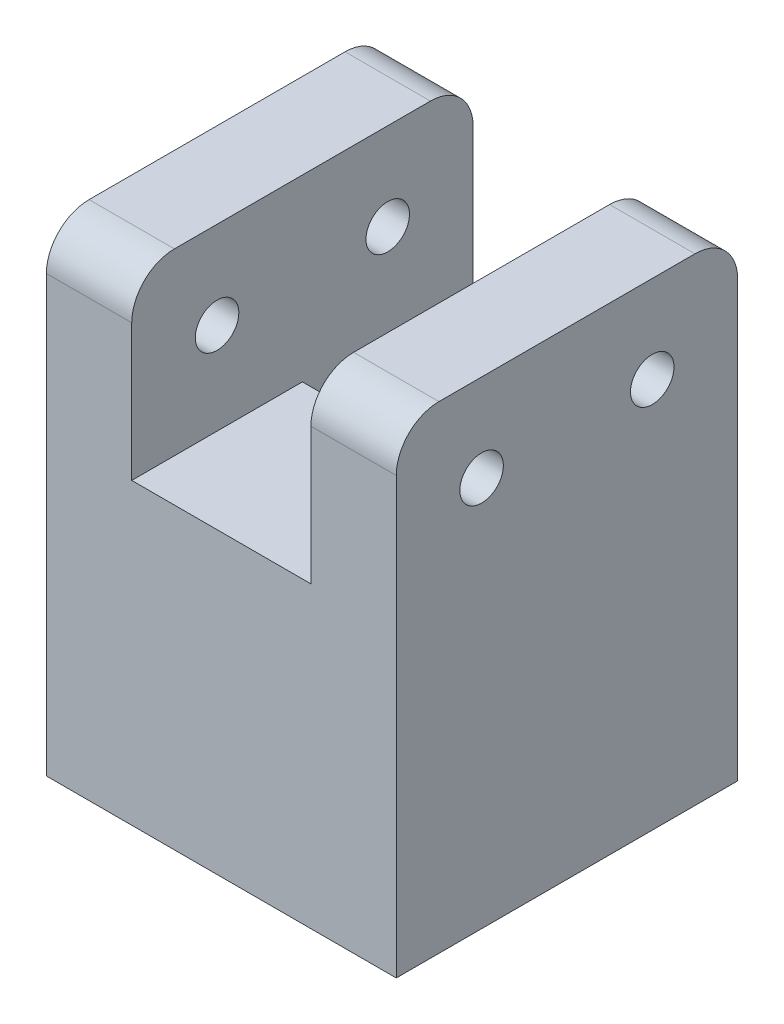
from build123d import *

# Parameters (mm, degrees)
BOSS_EXTRUDE1_DEPTH = 20
SKETCH16_R          = 2.55
CUT_EXTRUDE1_DEPTH  = 58.803546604
SKETCH20_W          = 41
SKETCH20_H          = 56
BOSS_EXTRUDE2_DEPTH = 20
SKETCH21_R          = 2.55
CUT_EXTRUDE2_DEPTH  = 58.803546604
SKETCH22_W          = 21
SKETCH22_H          = 20
CUT_EXTRUDE3_DEPTH  = 67.83000823
SKETCH24_W          = 21
SKETCH24_H          = 10
BOSS_EXTRUDE4_DEPTH = 20
FILLET1_R           = 5


with BuildPart() as part:
    # Sketch1 → Boss-Extrude1 (new body)
    with BuildSketch(Plane.XY):
        Polygon((20.5, 20.5), (20.5, -0.5), (-0.5, -0.5), (-0.5, 20.5), (-10.5, 20.5), (-10.5, -20.5), (-10.5, -35.5), (30.5, -35.5), (30.5, -20.5), (30.5, 20.5), align=None)
    extrude(amount=BOSS_EXTRUDE1_DEPTH)

    # Sketch16 → Cut-Extrude1 (cut, through all)
    with BuildSketch(Plane(origin=(30.5, 0, 0), x_dir=(0, 0, -1), z_dir=(1, 0, 0))):
        with Locations((-30, 10.25)):
            Circle(SKETCH16_R)
        with Locations((-10, 10.25)):
            Circle(SKETCH16_R)
    extrude(amount=-CUT_EXTRUDE1_DEPTH, mode=Mode.SUBTRACT)

    # Sketch20 → Boss-Extrude2 (add)
    with BuildSketch(Plane(origin=(0, 0, 0), x_dir=(-1, 0, 0), z_dir=(0, 0, -1))):
        with Locations((-10, -7.5)):
            Rectangle(SKETCH20_W, SKETCH20_H)
    extrude(amount=BOSS_EXTRUDE2_DEPTH)

    # Sketch21 → Cut-Extrude2 (cut, through all)
    with BuildSketch(Plane.ZY.offset(10.5)):
        with Locations((-10, 10.25)):
            Circle(SKETCH21_R)
    extrude(amount=-CUT_EXTRUDE2_DEPTH, mode=Mode.SUBTRACT)

    # Sketch22 → Cut-Extrude3 (cut, through all)
    with BuildSketch(Plane(origin=(0, 20.5, 0), x_dir=(1, 0, 0), z_dir=(0, 1, 0))):
        with Locations((10, 10)):
            Rectangle(SKETCH22_W, SKETCH22_H)
    extrude(amount=-CUT_EXTRUDE3_DEPTH, mode=Mode.SUBTRACT)

    # Sketch24 → Boss-Extrude4 (add, through all)
    with BuildSketch(Plane(origin=(0, 0, 0), x_dir=(-1, 0, 0), z_dir=(0, 0, -1))):
        with Locations((-10, -30.5)):
            Rectangle(SKETCH24_W, SKETCH24_H)
    extrude(amount=BOSS_EXTRUDE4_DEPTH)

    # Fillet1
    fillet1_edges = [part.edges().sort_by_distance(p)[0] for p in [
        (-5.5, 20.5, 20),
        (-5.5, 20.5, -20),
        (25.5, 20.5, 20),
        (25.5, 20.5, -20),
        (10, -25.5, 0),
    ]]
    fillet(fillet1_edges, radius=FILLET1_R)


solid = part.part
